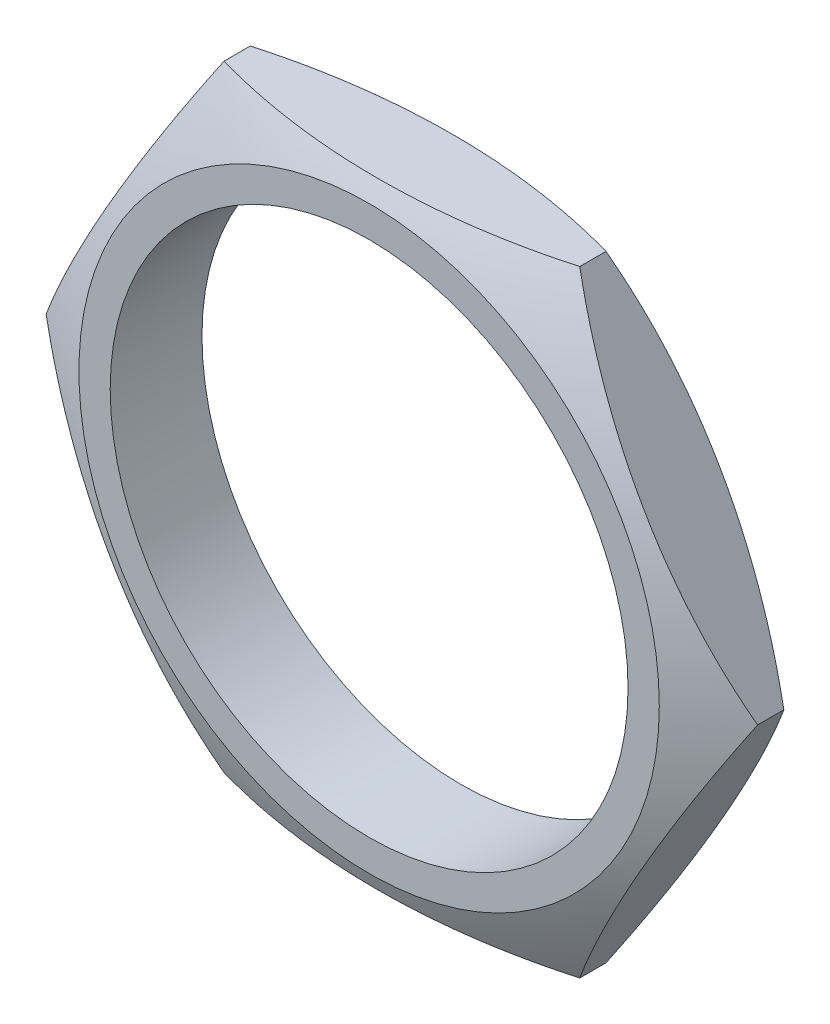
from build123d import *

# Parameters (mm, degrees)
ESQUISSE1_R        = 7.9
BOSS_EXTRU_1_DEPTH = 1.4


with BuildPart() as part:
    # Esquisse1 → Boss.-Extru.1 (new, symmetric)
    with BuildSketch(Plane.XY):
        Polygon((10.854185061, 0), (5.42709253, 9.4), (-5.42709253, 9.4), (-10.854185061, 0), (-5.42709253, -9.4), (5.42709253, -9.4), align=None)
        Circle(ESQUISSE1_R, mode=Mode.SUBTRACT)
    extrude(amount=BOSS_EXTRU_1_DEPTH, both=True)

    # Esquisse2 → Enl_vement de mati_re-R_volution1 (revolve, cut)
    with BuildSketch(Plane(origin=(0, 0, 0), x_dir=(1, 0, 0), z_dir=(0, 1, 0)), mode=Mode.PRIVATE) as enl_vement_de_mati_re_r_volution1_sk:
        with BuildLine():
            Line((-10.854185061, 1.4), (-10.854185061, 0.4))
            ThreePointArc((-10.854185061, 0.4), (-9.866861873, 0.925353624), (-8.854185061, 1.4))
            Line((-8.854185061, 1.4), (-10.854185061, 1.4))
        make_face()
    enl_vement_de_mati_re_r_volution1 = revolve(enl_vement_de_mati_re_r_volution1_sk.sketch.rotate(Axis((0, 0, 0), (0, 0, -1)), 180), axis=Axis((0, 0, 0), (0, 0, -1)), mode=Mode.SUBTRACT)

    # Sym_trie1: Enl_vement de mati_re-R_volution1 across plane
    add(enl_vement_de_mati_re_r_volution1.mirror(Plane.XY), mode=Mode.SUBTRACT)


solid = part.part
